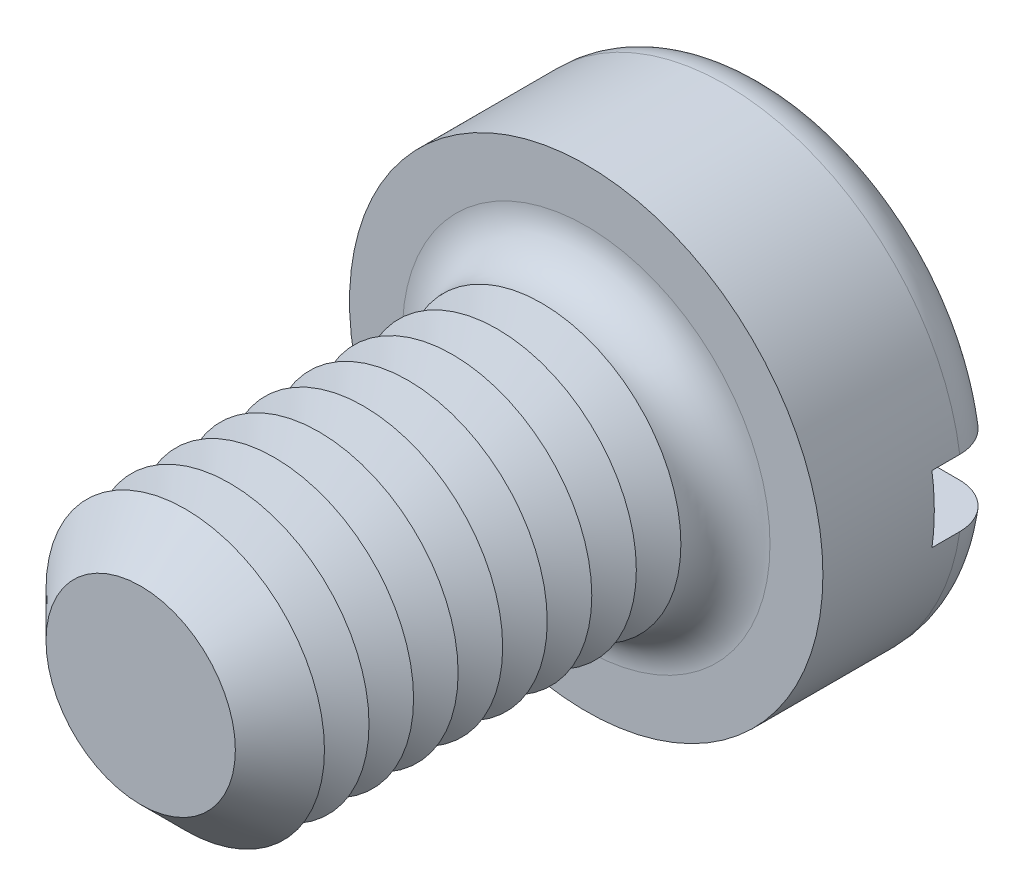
from build123d import *

# Parameters (mm, degrees)
SKETCH3_R           = 4.25
BOSS_EXTRUDE2_DEPTH = 3.3
SKETCH4_R           = 2.5
BOSS_EXTRUDE3_DEPTH = 8
FILLET1_R           = 0.8
CHAMFER1_SIZE       = 0.8
LPATTERN1_COUNT     = 8
LPATTERN1_PITCH     = 0.8
SKETCH8_W           = 8.5
SKETCH8_H           = 1.2
CUT_EXTRUDE1_DEPTH  = 1.3


with BuildPart() as part:
    # Sketch3 → Boss-Extrude2 (new body)
    with BuildSketch(Plane.XY):
        Circle(SKETCH3_R)
    extrude(amount=-BOSS_EXTRUDE2_DEPTH)

    # Sketch4 → Boss-Extrude3 (add)
    with BuildSketch(Plane.XY):
        Circle(SKETCH4_R)
    extrude(amount=BOSS_EXTRUDE3_DEPTH)

    # Fillet1
    fillet1_edges = [part.edges().sort_by_distance(p)[0] for p in [
        (-4.25, 0, -3.3),
        (-2.5, 0, 0),
    ]]
    fillet(fillet1_edges, radius=FILLET1_R)

    # Chamfer1
    chamfer1_edges = [part.edges().sort_by_distance(p)[0] for p in [
        (-2.5, 0, 8),
    ]]
    chamfer(chamfer1_edges, length=CHAMFER1_SIZE)

    # Sketch6 → Cut-Revolve1 (revolve, cut)
    with BuildSketch(Plane(origin=(0, 0, 0), x_dir=(0, 0, -1), z_dir=(1, 0, 0)), mode=Mode.PRIVATE) as cut_revolve1_sk:
        Polygon((-0.8, 2.5), (-1.2, 1.807179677), (-1.6, 2.5), align=None)
    cut_revolve1 = revolve(cut_revolve1_sk.sketch.rotate(Axis((0, 0, -1.694361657), (0, 0, 1)), 90), axis=Axis((0, 0, -1.694361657), (0, 0, 1)), mode=Mode.SUBTRACT)

    # LPattern1: Cut-Revolve1 ×8
    with Locations(*[(0, 0, i * LPATTERN1_PITCH) for i in range(1, LPATTERN1_COUNT)]):
        add(cut_revolve1, mode=Mode.SUBTRACT)

    # Sketch8 → Cut-Extrude1 (cut)
    with BuildSketch(Plane(origin=(0, 0, -3.3), x_dir=(-1, 0, 0), z_dir=(0, 0, -1))):
        Rectangle(SKETCH8_W, SKETCH8_H)
    extrude(amount=-CUT_EXTRUDE1_DEPTH, mode=Mode.SUBTRACT)


solid = part.part
